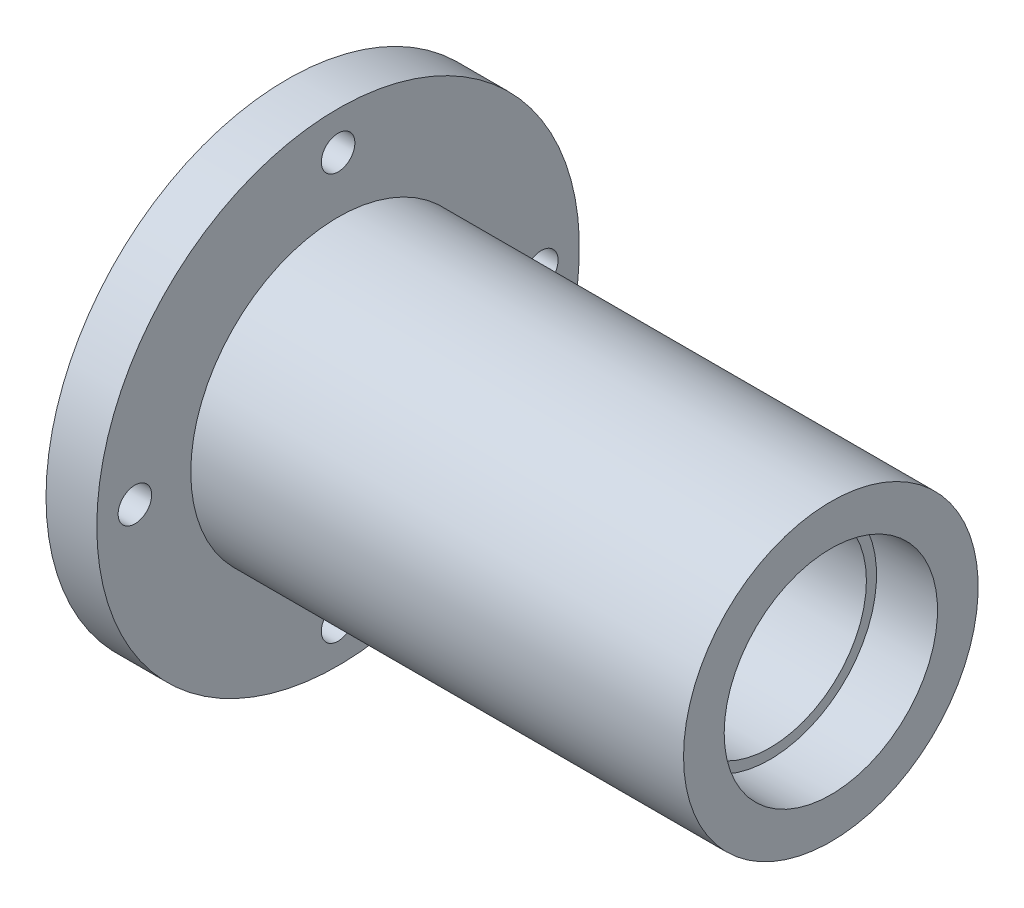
ISO-10303-21;
HEADER;
FILE_DESCRIPTION(('STEP AP214'),'2;1');
FILE_NAME('part.step','',(''),(''),'','','');
FILE_SCHEMA(('AUTOMOTIVE_DESIGN { 1 0 10303 214 1 1 1 1 }'));
ENDSEC;
DATA;
#1=APPLICATION_CONTEXT('core data for automotive mechanical design processes');
#2=APPLICATION_PROTOCOL_DEFINITION('international standard','automotive_design',2000,#1);
#3=PRODUCT_CONTEXT('',#1,'mechanical');
#4=PRODUCT('Part','Part','',(#3));
#5=PRODUCT_RELATED_PRODUCT_CATEGORY('part','',(#4));
#6=PRODUCT_DEFINITION_FORMATION('','',#4);
#7=PRODUCT_DEFINITION_CONTEXT('part definition',#1,'design');
#8=PRODUCT_DEFINITION('design','',#6,#7);
#9=PRODUCT_DEFINITION_SHAPE('','',#8);
#10=(LENGTH_UNIT() NAMED_UNIT(*) SI_UNIT(.MILLI.,.METRE.));
#11=(NAMED_UNIT(*) PLANE_ANGLE_UNIT() SI_UNIT($,.RADIAN.));
#12=(NAMED_UNIT(*) SI_UNIT($,.STERADIAN.) SOLID_ANGLE_UNIT());
#13=UNCERTAINTY_MEASURE_WITH_UNIT(LENGTH_MEASURE(1.E-05),#10,'distance_accuracy_value','');
#14=(GEOMETRIC_REPRESENTATION_CONTEXT(3) GLOBAL_UNCERTAINTY_ASSIGNED_CONTEXT((#13)) GLOBAL_UNIT_ASSIGNED_CONTEXT((#10,
#11,#12)) REPRESENTATION_CONTEXT('',''));
#15=CARTESIAN_POINT('',(0.,0.,0.));
#16=DIRECTION('',(0.,0.,1.));
#17=DIRECTION('',(1.,0.,0.));
#18=AXIS2_PLACEMENT_3D('',#15,#16,#17);
#19=CARTESIAN_POINT('',(-23.2546239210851,0.,0.));
#20=DIRECTION('',(-1.,0.,0.));
#21=DIRECTION('',(0.,0.,1.));
#22=AXIS2_PLACEMENT_3D('',#19,#20,#21);
#23=CYLINDRICAL_SURFACE('',#22,30.);
#24=CARTESIAN_POINT('',(0.,0.,0.));
#25=DIRECTION('',(-1.,0.,0.));
#26=DIRECTION('',(0.,0.,1.));
#27=AXIS2_PLACEMENT_3D('',#24,#25,#26);
#28=CIRCLE('',#27,30.);
#29=CARTESIAN_POINT('',(0.,0.,30.));
#30=VERTEX_POINT('',#29);
#31=EDGE_CURVE('E10',#30,#30,#28,.T.);
#32=ORIENTED_EDGE('',*,*,#31,.F.);
#33=EDGE_LOOP('',(#32));
#34=FACE_BOUND('',#33,.T.);
#35=CARTESIAN_POINT('',(3.,0.,0.));
#36=DIRECTION('',(-1.,0.,0.));
#37=DIRECTION('',(0.,0.,1.));
#38=AXIS2_PLACEMENT_3D('',#35,#36,#37);
#39=CIRCLE('',#38,30.);
#40=CARTESIAN_POINT('',(3.,0.,30.));
#41=VERTEX_POINT('',#40);
#42=EDGE_CURVE('E49',#41,#41,#39,.T.);
#43=ORIENTED_EDGE('',*,*,#42,.T.);
#44=EDGE_LOOP('',(#43));
#45=FACE_BOUND('',#44,.T.);
#46=ADVANCED_FACE('F30',(#34,#45),#23,.T.);
#47=CARTESIAN_POINT('',(0.,22.5,0.));
#48=DIRECTION('',(1.,0.,0.));
#49=DIRECTION('',(0.,0.,-1.));
#50=AXIS2_PLACEMENT_3D('',#47,#48,#49);
#51=PLANE('',#50);
#52=CARTESIAN_POINT('',(0.,0.,0.));
#53=DIRECTION('',(-1.,0.,0.));
#54=DIRECTION('',(0.,0.,1.));
#55=AXIS2_PLACEMENT_3D('',#52,#53,#54);
#56=CIRCLE('',#55,22.5);
#57=CARTESIAN_POINT('',(0.,0.,22.5));
#58=VERTEX_POINT('',#57);
#59=EDGE_CURVE('E37',#58,#58,#56,.T.);
#60=ORIENTED_EDGE('',*,*,#59,.F.);
#61=EDGE_LOOP('',(#60));
#62=FACE_BOUND('',#61,.T.);
#63=ORIENTED_EDGE('',*,*,#31,.T.);
#64=EDGE_LOOP('',(#63));
#65=FACE_BOUND('',#64,.T.);
#66=ADVANCED_FACE('F110',(#62,#65),#51,.F.);
#67=CARTESIAN_POINT('',(-23.2546239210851,0.,0.));
#68=DIRECTION('',(-1.,0.,0.));
#69=DIRECTION('',(0.,0.,1.));
#70=AXIS2_PLACEMENT_3D('',#67,#68,#69);
#71=CYLINDRICAL_SURFACE('',#70,22.5);
#72=CARTESIAN_POINT('',(20.,0.,0.));
#73=DIRECTION('',(-1.,0.,0.));
#74=DIRECTION('',(0.,0.,1.));
#75=AXIS2_PLACEMENT_3D('',#72,#73,#74);
#76=CIRCLE('',#75,22.5);
#77=CARTESIAN_POINT('',(20.,0.,22.5));
#78=VERTEX_POINT('',#77);
#79=EDGE_CURVE('E42',#78,#78,#76,.T.);
#80=ORIENTED_EDGE('',*,*,#79,.F.);
#81=EDGE_LOOP('',(#80));
#82=FACE_BOUND('',#81,.T.);
#83=ORIENTED_EDGE('',*,*,#59,.T.);
#84=EDGE_LOOP('',(#83));
#85=FACE_BOUND('',#84,.T.);
#86=ADVANCED_FACE('F107',(#82,#85),#71,.F.);
#87=CARTESIAN_POINT('',(20.,21.,0.));
#88=DIRECTION('',(1.,0.,0.));
#89=DIRECTION('',(0.,0.,-1.));
#90=AXIS2_PLACEMENT_3D('',#87,#88,#89);
#91=PLANE('',#90);
#92=CARTESIAN_POINT('',(20.,0.,0.));
#93=DIRECTION('',(-1.,0.,0.));
#94=DIRECTION('',(0.,0.,1.));
#95=AXIS2_PLACEMENT_3D('',#92,#93,#94);
#96=CIRCLE('',#95,21.);
#97=CARTESIAN_POINT('',(20.,0.,21.));
#98=VERTEX_POINT('',#97);
#99=EDGE_CURVE('E100',#98,#98,#96,.T.);
#100=ORIENTED_EDGE('',*,*,#99,.F.);
#101=EDGE_LOOP('',(#100));
#102=FACE_BOUND('',#101,.T.);
#103=ORIENTED_EDGE('',*,*,#79,.T.);
#104=EDGE_LOOP('',(#103));
#105=FACE_BOUND('',#104,.T.);
#106=ADVANCED_FACE('F105',(#102,#105),#91,.F.);
#107=CARTESIAN_POINT('',(-23.2546239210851,0.,0.));
#108=DIRECTION('',(-1.,0.,0.));
#109=DIRECTION('',(0.,0.,1.));
#110=AXIS2_PLACEMENT_3D('',#107,#108,#109);
#111=CYLINDRICAL_SURFACE('',#110,21.);
#112=CARTESIAN_POINT('',(32.,0.,0.));
#113=DIRECTION('',(-1.,0.,0.));
#114=DIRECTION('',(0.,0.,1.));
#115=AXIS2_PLACEMENT_3D('',#112,#113,#114);
#116=CIRCLE('',#115,21.);
#117=CARTESIAN_POINT('',(32.,0.,21.));
#118=VERTEX_POINT('',#117);
#119=EDGE_CURVE('E97',#118,#118,#116,.T.);
#120=ORIENTED_EDGE('',*,*,#119,.F.);
#121=EDGE_LOOP('',(#120));
#122=FACE_BOUND('',#121,.T.);
#123=ORIENTED_EDGE('',*,*,#99,.T.);
#124=EDGE_LOOP('',(#123));
#125=FACE_BOUND('',#124,.T.);
#126=ADVANCED_FACE('F122',(#122,#125),#111,.F.);
#127=CARTESIAN_POINT('',(32.,19.,0.));
#128=DIRECTION('',(1.,0.,0.));
#129=DIRECTION('',(0.,0.,-1.));
#130=AXIS2_PLACEMENT_3D('',#127,#128,#129);
#131=PLANE('',#130);
#132=CARTESIAN_POINT('',(32.,0.,0.));
#133=DIRECTION('',(-1.,0.,0.));
#134=DIRECTION('',(0.,0.,1.));
#135=AXIS2_PLACEMENT_3D('',#132,#133,#134);
#136=CIRCLE('',#135,19.);
#137=CARTESIAN_POINT('',(32.,0.,19.));
#138=VERTEX_POINT('',#137);
#139=EDGE_CURVE('E94',#138,#138,#136,.T.);
#140=ORIENTED_EDGE('',*,*,#139,.F.);
#141=EDGE_LOOP('',(#140));
#142=FACE_BOUND('',#141,.T.);
#143=ORIENTED_EDGE('',*,*,#119,.T.);
#144=EDGE_LOOP('',(#143));
#145=FACE_BOUND('',#144,.T.);
#146=ADVANCED_FACE('F126',(#142,#145),#131,.F.);
#147=CARTESIAN_POINT('',(-23.2546239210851,0.,0.));
#148=DIRECTION('',(-1.,0.,0.));
#149=DIRECTION('',(0.,0.,1.));
#150=AXIS2_PLACEMENT_3D('',#147,#148,#149);
#151=CYLINDRICAL_SURFACE('',#150,19.);
#152=CARTESIAN_POINT('',(98.,0.,0.));
#153=DIRECTION('',(-1.,0.,0.));
#154=DIRECTION('',(0.,0.,1.));
#155=AXIS2_PLACEMENT_3D('',#152,#153,#154);
#156=CIRCLE('',#155,19.);
#157=CARTESIAN_POINT('',(98.,0.,19.));
#158=VERTEX_POINT('',#157);
#159=EDGE_CURVE('E91',#158,#158,#156,.T.);
#160=ORIENTED_EDGE('',*,*,#159,.F.);
#161=EDGE_LOOP('',(#160));
#162=FACE_BOUND('',#161,.T.);
#163=ORIENTED_EDGE('',*,*,#139,.T.);
#164=EDGE_LOOP('',(#163));
#165=FACE_BOUND('',#164,.T.);
#166=ADVANCED_FACE('F130',(#162,#165),#151,.F.);
#167=CARTESIAN_POINT('',(98.,21.,0.));
#168=DIRECTION('',(-1.,0.,0.));
#169=DIRECTION('',(0.,0.,1.));
#170=AXIS2_PLACEMENT_3D('',#167,#168,#169);
#171=PLANE('',#170);
#172=CARTESIAN_POINT('',(98.,0.,0.));
#173=DIRECTION('',(-1.,0.,0.));
#174=DIRECTION('',(0.,0.,1.));
#175=AXIS2_PLACEMENT_3D('',#172,#173,#174);
#176=CIRCLE('',#175,21.);
#177=CARTESIAN_POINT('',(98.,0.,21.));
#178=VERTEX_POINT('',#177);
#179=EDGE_CURVE('E88',#178,#178,#176,.T.);
#180=ORIENTED_EDGE('',*,*,#179,.F.);
#181=EDGE_LOOP('',(#180));
#182=FACE_BOUND('',#181,.T.);
#183=ORIENTED_EDGE('',*,*,#159,.T.);
#184=EDGE_LOOP('',(#183));
#185=FACE_BOUND('',#184,.T.);
#186=ADVANCED_FACE('F134',(#182,#185),#171,.F.);
#187=CARTESIAN_POINT('',(-23.2546239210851,0.,0.));
#188=DIRECTION('',(-1.,0.,0.));
#189=DIRECTION('',(0.,0.,1.));
#190=AXIS2_PLACEMENT_3D('',#187,#188,#189);
#191=CYLINDRICAL_SURFACE('',#190,21.);
#192=CARTESIAN_POINT('',(110.,0.,0.));
#193=DIRECTION('',(-1.,0.,0.));
#194=DIRECTION('',(0.,0.,1.));
#195=AXIS2_PLACEMENT_3D('',#192,#193,#194);
#196=CIRCLE('',#195,21.);
#197=CARTESIAN_POINT('',(110.,0.,21.));
#198=VERTEX_POINT('',#197);
#199=EDGE_CURVE('E85',#198,#198,#196,.T.);
#200=ORIENTED_EDGE('',*,*,#199,.F.);
#201=EDGE_LOOP('',(#200));
#202=FACE_BOUND('',#201,.T.);
#203=ORIENTED_EDGE('',*,*,#179,.T.);
#204=EDGE_LOOP('',(#203));
#205=FACE_BOUND('',#204,.T.);
#206=ADVANCED_FACE('F138',(#202,#205),#191,.F.);
#207=CARTESIAN_POINT('',(110.,29.,0.));
#208=DIRECTION('',(-1.,0.,0.));
#209=DIRECTION('',(0.,0.,1.));
#210=AXIS2_PLACEMENT_3D('',#207,#208,#209);
#211=PLANE('',#210);
#212=CARTESIAN_POINT('',(110.,0.,0.));
#213=DIRECTION('',(-1.,0.,0.));
#214=DIRECTION('',(0.,0.,1.));
#215=AXIS2_PLACEMENT_3D('',#212,#213,#214);
#216=CIRCLE('',#215,29.);
#217=CARTESIAN_POINT('',(110.,0.,29.));
#218=VERTEX_POINT('',#217);
#219=EDGE_CURVE('E82',#218,#218,#216,.T.);
#220=ORIENTED_EDGE('',*,*,#219,.F.);
#221=EDGE_LOOP('',(#220));
#222=FACE_BOUND('',#221,.T.);
#223=ORIENTED_EDGE('',*,*,#199,.T.);
#224=EDGE_LOOP('',(#223));
#225=FACE_BOUND('',#224,.T.);
#226=ADVANCED_FACE('F142',(#222,#225),#211,.F.);
#227=CARTESIAN_POINT('',(-23.2546239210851,0.,0.));
#228=DIRECTION('',(-1.,0.,0.));
#229=DIRECTION('',(0.,0.,1.));
#230=AXIS2_PLACEMENT_3D('',#227,#228,#229);
#231=CYLINDRICAL_SURFACE('',#230,29.);
#232=CARTESIAN_POINT('',(13.,0.,0.));
#233=DIRECTION('',(-1.,0.,0.));
#234=DIRECTION('',(0.,0.,1.));
#235=AXIS2_PLACEMENT_3D('',#232,#233,#234);
#236=CIRCLE('',#235,29.);
#237=CARTESIAN_POINT('',(13.,0.,29.));
#238=VERTEX_POINT('',#237);
#239=EDGE_CURVE('E79',#238,#238,#236,.T.);
#240=ORIENTED_EDGE('',*,*,#239,.F.);
#241=EDGE_LOOP('',(#240));
#242=FACE_BOUND('',#241,.T.);
#243=ORIENTED_EDGE('',*,*,#219,.T.);
#244=EDGE_LOOP('',(#243));
#245=FACE_BOUND('',#244,.T.);
#246=ADVANCED_FACE('F146',(#242,#245),#231,.T.);
#247=CARTESIAN_POINT('',(13.,47.5,0.));
#248=DIRECTION('',(-1.,0.,0.));
#249=DIRECTION('',(0.,0.,1.));
#250=AXIS2_PLACEMENT_3D('',#247,#248,#249);
#251=PLANE('',#250);
#252=CARTESIAN_POINT('',(13.,40.,0.));
#253=DIRECTION('',(-1.,0.,0.));
#254=DIRECTION('',(0.,0.,1.));
#255=AXIS2_PLACEMENT_3D('',#252,#253,#254);
#256=CIRCLE('',#255,3.29999999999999);
#257=CARTESIAN_POINT('',(13.,40.,3.29999999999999));
#258=VERTEX_POINT('',#257);
#259=EDGE_CURVE('E33',#258,#258,#256,.T.);
#260=ORIENTED_EDGE('',*,*,#259,.T.);
#261=EDGE_LOOP('',(#260));
#262=FACE_BOUND('',#261,.T.);
#263=CARTESIAN_POINT('',(13.,0.,40.));
#264=DIRECTION('',(-1.,0.,0.));
#265=DIRECTION('',(0.,0.,1.));
#266=AXIS2_PLACEMENT_3D('',#263,#264,#265);
#267=CIRCLE('',#266,3.29999999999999);
#268=CARTESIAN_POINT('',(13.,0.,43.3));
#269=VERTEX_POINT('',#268);
#270=EDGE_CURVE('E54',#269,#269,#267,.T.);
#271=ORIENTED_EDGE('',*,*,#270,.T.);
#272=EDGE_LOOP('',(#271));
#273=FACE_BOUND('',#272,.T.);
#274=CARTESIAN_POINT('',(13.,0.,-40.));
#275=DIRECTION('',(-1.,0.,0.));
#276=DIRECTION('',(0.,0.,1.));
#277=AXIS2_PLACEMENT_3D('',#274,#275,#276);
#278=CIRCLE('',#277,3.29999999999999);
#279=CARTESIAN_POINT('',(13.,0.,-36.7));
#280=VERTEX_POINT('',#279);
#281=EDGE_CURVE('E51',#280,#280,#278,.T.);
#282=ORIENTED_EDGE('',*,*,#281,.T.);
#283=EDGE_LOOP('',(#282));
#284=FACE_BOUND('',#283,.T.);
#285=CARTESIAN_POINT('',(13.,-40.,0.));
#286=DIRECTION('',(-1.,0.,0.));
#287=DIRECTION('',(0.,0.,1.));
#288=AXIS2_PLACEMENT_3D('',#285,#286,#287);
#289=CIRCLE('',#288,3.29999999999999);
#290=CARTESIAN_POINT('',(13.,-40.,3.29999999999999));
#291=VERTEX_POINT('',#290);
#292=EDGE_CURVE('E46',#291,#291,#289,.T.);
#293=ORIENTED_EDGE('',*,*,#292,.T.);
#294=EDGE_LOOP('',(#293));
#295=FACE_BOUND('',#294,.T.);
#296=CARTESIAN_POINT('',(13.,0.,0.));
#297=DIRECTION('',(-1.,0.,0.));
#298=DIRECTION('',(0.,0.,1.));
#299=AXIS2_PLACEMENT_3D('',#296,#297,#298);
#300=CIRCLE('',#299,47.5);
#301=CARTESIAN_POINT('',(13.,0.,47.5));
#302=VERTEX_POINT('',#301);
#303=EDGE_CURVE('E76',#302,#302,#300,.T.);
#304=ORIENTED_EDGE('',*,*,#303,.F.);
#305=EDGE_LOOP('',(#304));
#306=FACE_BOUND('',#305,.T.);
#307=ORIENTED_EDGE('',*,*,#239,.T.);
#308=EDGE_LOOP('',(#307));
#309=FACE_BOUND('',#308,.T.);
#310=ADVANCED_FACE('F150',(#262,#273,#284,#295,#306,#309),#251,.F.);
#311=CARTESIAN_POINT('',(-23.2546239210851,0.,0.));
#312=DIRECTION('',(-1.,0.,0.));
#313=DIRECTION('',(0.,0.,1.));
#314=AXIS2_PLACEMENT_3D('',#311,#312,#313);
#315=CYLINDRICAL_SURFACE('',#314,47.5);
#316=CARTESIAN_POINT('',(3.,0.,0.));
#317=DIRECTION('',(-1.,0.,0.));
#318=DIRECTION('',(0.,0.,1.));
#319=AXIS2_PLACEMENT_3D('',#316,#317,#318);
#320=CIRCLE('',#319,47.5);
#321=CARTESIAN_POINT('',(3.,0.,47.5));
#322=VERTEX_POINT('',#321);
#323=EDGE_CURVE('E73',#322,#322,#320,.T.);
#324=ORIENTED_EDGE('',*,*,#323,.F.);
#325=EDGE_LOOP('',(#324));
#326=FACE_BOUND('',#325,.T.);
#327=ORIENTED_EDGE('',*,*,#303,.T.);
#328=EDGE_LOOP('',(#327));
#329=FACE_BOUND('',#328,.T.);
#330=ADVANCED_FACE('F154',(#326,#329),#315,.T.);
#331=CARTESIAN_POINT('',(3.,30.,0.));
#332=DIRECTION('',(1.,0.,0.));
#333=DIRECTION('',(0.,0.,-1.));
#334=AXIS2_PLACEMENT_3D('',#331,#332,#333);
#335=PLANE('',#334);
#336=CARTESIAN_POINT('',(3.,40.,0.));
#337=DIRECTION('',(-1.,0.,0.));
#338=DIRECTION('',(0.,0.,1.));
#339=AXIS2_PLACEMENT_3D('',#336,#337,#338);
#340=CIRCLE('',#339,3.29999999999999);
#341=CARTESIAN_POINT('',(3.,40.,3.29999999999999));
#342=VERTEX_POINT('',#341);
#343=EDGE_CURVE('E66',#342,#342,#340,.T.);
#344=ORIENTED_EDGE('',*,*,#343,.F.);
#345=EDGE_LOOP('',(#344));
#346=FACE_BOUND('',#345,.T.);
#347=CARTESIAN_POINT('',(3.,0.,40.));
#348=DIRECTION('',(-1.,0.,0.));
#349=DIRECTION('',(0.,0.,1.));
#350=AXIS2_PLACEMENT_3D('',#347,#348,#349);
#351=CIRCLE('',#350,3.29999999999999);
#352=CARTESIAN_POINT('',(3.,0.,43.3));
#353=VERTEX_POINT('',#352);
#354=EDGE_CURVE('E56',#353,#353,#351,.T.);
#355=ORIENTED_EDGE('',*,*,#354,.F.);
#356=EDGE_LOOP('',(#355));
#357=FACE_BOUND('',#356,.T.);
#358=CARTESIAN_POINT('',(3.,0.,-40.));
#359=DIRECTION('',(-1.,0.,0.));
#360=DIRECTION('',(0.,0.,1.));
#361=AXIS2_PLACEMENT_3D('',#358,#359,#360);
#362=CIRCLE('',#361,3.29999999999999);
#363=CARTESIAN_POINT('',(3.,0.,-36.7));
#364=VERTEX_POINT('',#363);
#365=EDGE_CURVE('E53',#364,#364,#362,.T.);
#366=ORIENTED_EDGE('',*,*,#365,.F.);
#367=EDGE_LOOP('',(#366));
#368=FACE_BOUND('',#367,.T.);
#369=CARTESIAN_POINT('',(3.,-40.,0.));
#370=DIRECTION('',(-1.,0.,0.));
#371=DIRECTION('',(0.,0.,1.));
#372=AXIS2_PLACEMENT_3D('',#369,#370,#371);
#373=CIRCLE('',#372,3.29999999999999);
#374=CARTESIAN_POINT('',(3.,-40.,3.29999999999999));
#375=VERTEX_POINT('',#374);
#376=EDGE_CURVE('E50',#375,#375,#373,.T.);
#377=ORIENTED_EDGE('',*,*,#376,.F.);
#378=EDGE_LOOP('',(#377));
#379=FACE_BOUND('',#378,.T.);
#380=ORIENTED_EDGE('',*,*,#42,.F.);
#381=EDGE_LOOP('',(#380));
#382=FACE_BOUND('',#381,.T.);
#383=ORIENTED_EDGE('',*,*,#323,.T.);
#384=EDGE_LOOP('',(#383));
#385=FACE_BOUND('',#384,.T.);
#386=ADVANCED_FACE('F158',(#346,#357,#368,#379,#382,#385),#335,.F.);
#387=CARTESIAN_POINT('',(3.,-40.,0.));
#388=DIRECTION('',(-1.,0.,0.));
#389=DIRECTION('',(0.,0.,1.));
#390=AXIS2_PLACEMENT_3D('',#387,#388,#389);
#391=CYLINDRICAL_SURFACE('',#390,3.29999999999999);
#392=ORIENTED_EDGE('',*,*,#376,.T.);
#393=EDGE_LOOP('',(#392));
#394=FACE_BOUND('',#393,.T.);
#395=ORIENTED_EDGE('',*,*,#292,.F.);
#396=EDGE_LOOP('',(#395));
#397=FACE_BOUND('',#396,.T.);
#398=ADVANCED_FACE('F162',(#394,#397),#391,.F.);
#399=CARTESIAN_POINT('',(3.,0.,-40.));
#400=DIRECTION('',(-1.,0.,0.));
#401=DIRECTION('',(0.,0.,1.));
#402=AXIS2_PLACEMENT_3D('',#399,#400,#401);
#403=CYLINDRICAL_SURFACE('',#402,3.29999999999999);
#404=ORIENTED_EDGE('',*,*,#365,.T.);
#405=EDGE_LOOP('',(#404));
#406=FACE_BOUND('',#405,.T.);
#407=ORIENTED_EDGE('',*,*,#281,.F.);
#408=EDGE_LOOP('',(#407));
#409=FACE_BOUND('',#408,.T.);
#410=ADVANCED_FACE('F166',(#406,#409),#403,.F.);
#411=CARTESIAN_POINT('',(3.,0.,40.));
#412=DIRECTION('',(-1.,0.,0.));
#413=DIRECTION('',(0.,0.,1.));
#414=AXIS2_PLACEMENT_3D('',#411,#412,#413);
#415=CYLINDRICAL_SURFACE('',#414,3.29999999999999);
#416=ORIENTED_EDGE('',*,*,#354,.T.);
#417=EDGE_LOOP('',(#416));
#418=FACE_BOUND('',#417,.T.);
#419=ORIENTED_EDGE('',*,*,#270,.F.);
#420=EDGE_LOOP('',(#419));
#421=FACE_BOUND('',#420,.T.);
#422=ADVANCED_FACE('F170',(#418,#421),#415,.F.);
#423=CARTESIAN_POINT('',(3.,40.,0.));
#424=DIRECTION('',(-1.,0.,0.));
#425=DIRECTION('',(0.,0.,1.));
#426=AXIS2_PLACEMENT_3D('',#423,#424,#425);
#427=CYLINDRICAL_SURFACE('',#426,3.29999999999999);
#428=ORIENTED_EDGE('',*,*,#343,.T.);
#429=EDGE_LOOP('',(#428));
#430=FACE_BOUND('',#429,.T.);
#431=ORIENTED_EDGE('',*,*,#259,.F.);
#432=EDGE_LOOP('',(#431));
#433=FACE_BOUND('',#432,.T.);
#434=ADVANCED_FACE('F174',(#430,#433),#427,.F.);
#435=CLOSED_SHELL('',(#46,#66,#86,#106,#126,#146,#166,#186,#206,#226,#246,#310,#330,#386,#398,
#410,#422,#434));
#436=MANIFOLD_SOLID_BREP('B2',#435);
#437=ADVANCED_BREP_SHAPE_REPRESENTATION('',(#18,#436),#14);
#438=SHAPE_DEFINITION_REPRESENTATION(#9,#437);
ENDSEC;
END-ISO-10303-21;
